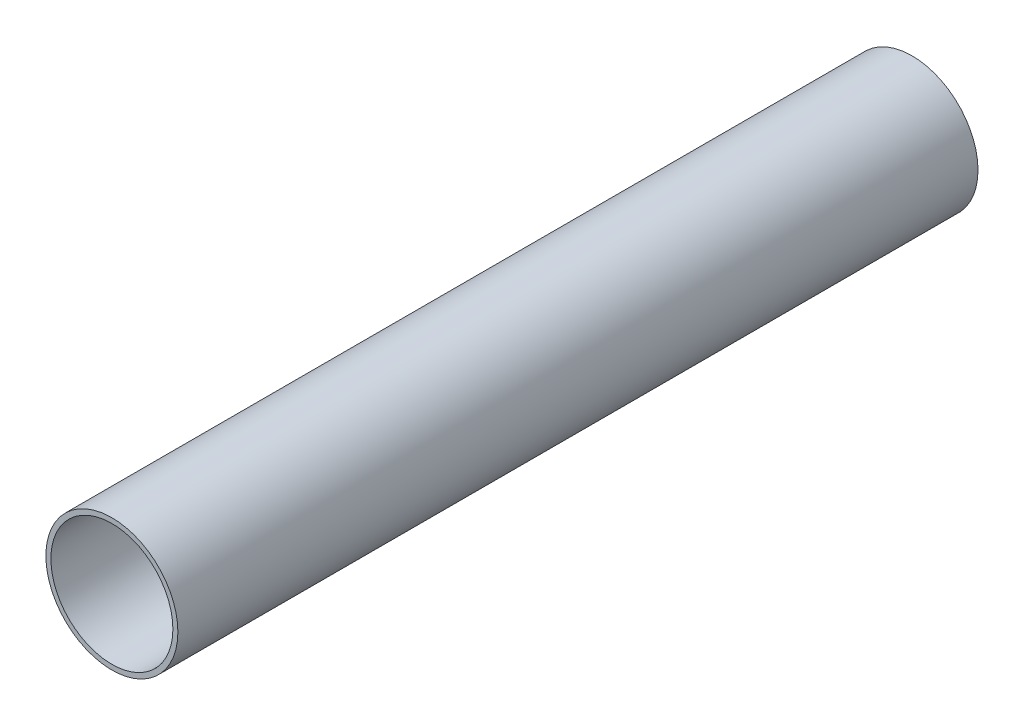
ISO-10303-21;
HEADER;
FILE_DESCRIPTION(('STEP AP214'),'2;1');
FILE_NAME('part.step','',(''),(''),'','','');
FILE_SCHEMA(('AUTOMOTIVE_DESIGN { 1 0 10303 214 1 1 1 1 }'));
ENDSEC;
DATA;
#1=APPLICATION_CONTEXT('core data for automotive mechanical design processes');
#2=APPLICATION_PROTOCOL_DEFINITION('international standard','automotive_design',2000,#1);
#3=PRODUCT_CONTEXT('',#1,'mechanical');
#4=PRODUCT('Part','Part','',(#3));
#5=PRODUCT_RELATED_PRODUCT_CATEGORY('part','',(#4));
#6=PRODUCT_DEFINITION_FORMATION('','',#4);
#7=PRODUCT_DEFINITION_CONTEXT('part definition',#1,'design');
#8=PRODUCT_DEFINITION('design','',#6,#7);
#9=PRODUCT_DEFINITION_SHAPE('','',#8);
#10=(LENGTH_UNIT() NAMED_UNIT(*) SI_UNIT(.MILLI.,.METRE.));
#11=(NAMED_UNIT(*) PLANE_ANGLE_UNIT() SI_UNIT($,.RADIAN.));
#12=(NAMED_UNIT(*) SI_UNIT($,.STERADIAN.) SOLID_ANGLE_UNIT());
#13=UNCERTAINTY_MEASURE_WITH_UNIT(LENGTH_MEASURE(1.E-05),#10,'distance_accuracy_value','');
#14=(GEOMETRIC_REPRESENTATION_CONTEXT(3) GLOBAL_UNCERTAINTY_ASSIGNED_CONTEXT((#13)) GLOBAL_UNIT_ASSIGNED_CONTEXT((#10,
#11,#12)) REPRESENTATION_CONTEXT('',''));
#15=CARTESIAN_POINT('',(0.,0.,0.));
#16=DIRECTION('',(0.,0.,1.));
#17=DIRECTION('',(1.,0.,0.));
#18=AXIS2_PLACEMENT_3D('',#15,#16,#17);
#19=CARTESIAN_POINT('',(0.,0.,254.));
#20=DIRECTION('',(0.,0.,1.));
#21=DIRECTION('',(1.,0.,0.));
#22=AXIS2_PLACEMENT_3D('',#19,#20,#21);
#23=PLANE('',#22);
#24=CARTESIAN_POINT('',(0.,0.,254.));
#25=DIRECTION('',(0.,0.,1.));
#26=DIRECTION('',(1.,0.,0.));
#27=AXIS2_PLACEMENT_3D('',#24,#25,#26);
#28=CIRCLE('',#27,20.955);
#29=CARTESIAN_POINT('',(20.955,0.,254.));
#30=VERTEX_POINT('',#29);
#31=EDGE_CURVE('E10',#30,#30,#28,.T.);
#32=ORIENTED_EDGE('',*,*,#31,.T.);
#33=EDGE_LOOP('',(#32));
#34=FACE_BOUND('',#33,.T.);
#35=CARTESIAN_POINT('',(0.,0.,254.));
#36=DIRECTION('',(0.,0.,1.));
#37=DIRECTION('',(1.,0.,0.));
#38=AXIS2_PLACEMENT_3D('',#35,#36,#37);
#39=CIRCLE('',#38,19.3675);
#40=CARTESIAN_POINT('',(19.3675,0.,254.));
#41=VERTEX_POINT('',#40);
#42=EDGE_CURVE('E40',#41,#41,#39,.T.);
#43=ORIENTED_EDGE('',*,*,#42,.F.);
#44=EDGE_LOOP('',(#43));
#45=FACE_BOUND('',#44,.T.);
#46=ADVANCED_FACE('F29',(#34,#45),#23,.T.);
#47=CARTESIAN_POINT('',(0.,0.,0.));
#48=DIRECTION('',(0.,0.,1.));
#49=DIRECTION('',(1.,0.,0.));
#50=AXIS2_PLACEMENT_3D('',#47,#48,#49);
#51=PLANE('',#50);
#52=CARTESIAN_POINT('',(0.,0.,0.));
#53=DIRECTION('',(0.,0.,1.));
#54=DIRECTION('',(1.,0.,0.));
#55=AXIS2_PLACEMENT_3D('',#52,#53,#54);
#56=CIRCLE('',#55,20.955);
#57=CARTESIAN_POINT('',(20.955,0.,0.));
#58=VERTEX_POINT('',#57);
#59=EDGE_CURVE('E36',#58,#58,#56,.T.);
#60=ORIENTED_EDGE('',*,*,#59,.F.);
#61=EDGE_LOOP('',(#60));
#62=FACE_BOUND('',#61,.T.);
#63=CARTESIAN_POINT('',(0.,0.,0.));
#64=DIRECTION('',(0.,0.,1.));
#65=DIRECTION('',(1.,0.,0.));
#66=AXIS2_PLACEMENT_3D('',#63,#64,#65);
#67=CIRCLE('',#66,19.3675);
#68=CARTESIAN_POINT('',(19.3675,0.,0.));
#69=VERTEX_POINT('',#68);
#70=EDGE_CURVE('E44',#69,#69,#67,.T.);
#71=ORIENTED_EDGE('',*,*,#70,.T.);
#72=EDGE_LOOP('',(#71));
#73=FACE_BOUND('',#72,.T.);
#74=ADVANCED_FACE('F50',(#62,#73),#51,.F.);
#75=CARTESIAN_POINT('',(0.,0.,254.));
#76=DIRECTION('',(0.,0.,-1.));
#77=DIRECTION('',(-1.,0.,0.));
#78=AXIS2_PLACEMENT_3D('',#75,#76,#77);
#79=CYLINDRICAL_SURFACE('',#78,20.955);
#80=ORIENTED_EDGE('',*,*,#31,.F.);
#81=EDGE_LOOP('',(#80));
#82=FACE_BOUND('',#81,.T.);
#83=ORIENTED_EDGE('',*,*,#59,.T.);
#84=EDGE_LOOP('',(#83));
#85=FACE_BOUND('',#84,.T.);
#86=ADVANCED_FACE('F31',(#82,#85),#79,.T.);
#87=CARTESIAN_POINT('',(0.,0.,254.));
#88=DIRECTION('',(0.,0.,-1.));
#89=DIRECTION('',(-1.,0.,0.));
#90=AXIS2_PLACEMENT_3D('',#87,#88,#89);
#91=CYLINDRICAL_SURFACE('',#90,19.3675);
#92=ORIENTED_EDGE('',*,*,#42,.T.);
#93=EDGE_LOOP('',(#92));
#94=FACE_BOUND('',#93,.T.);
#95=ORIENTED_EDGE('',*,*,#70,.F.);
#96=EDGE_LOOP('',(#95));
#97=FACE_BOUND('',#96,.T.);
#98=ADVANCED_FACE('F52',(#94,#97),#91,.F.);
#99=CLOSED_SHELL('',(#46,#74,#86,#98));
#100=MANIFOLD_SOLID_BREP('B2',#99);
#101=ADVANCED_BREP_SHAPE_REPRESENTATION('',(#18,#100),#14);
#102=SHAPE_DEFINITION_REPRESENTATION(#9,#101);
ENDSEC;
END-ISO-10303-21;
